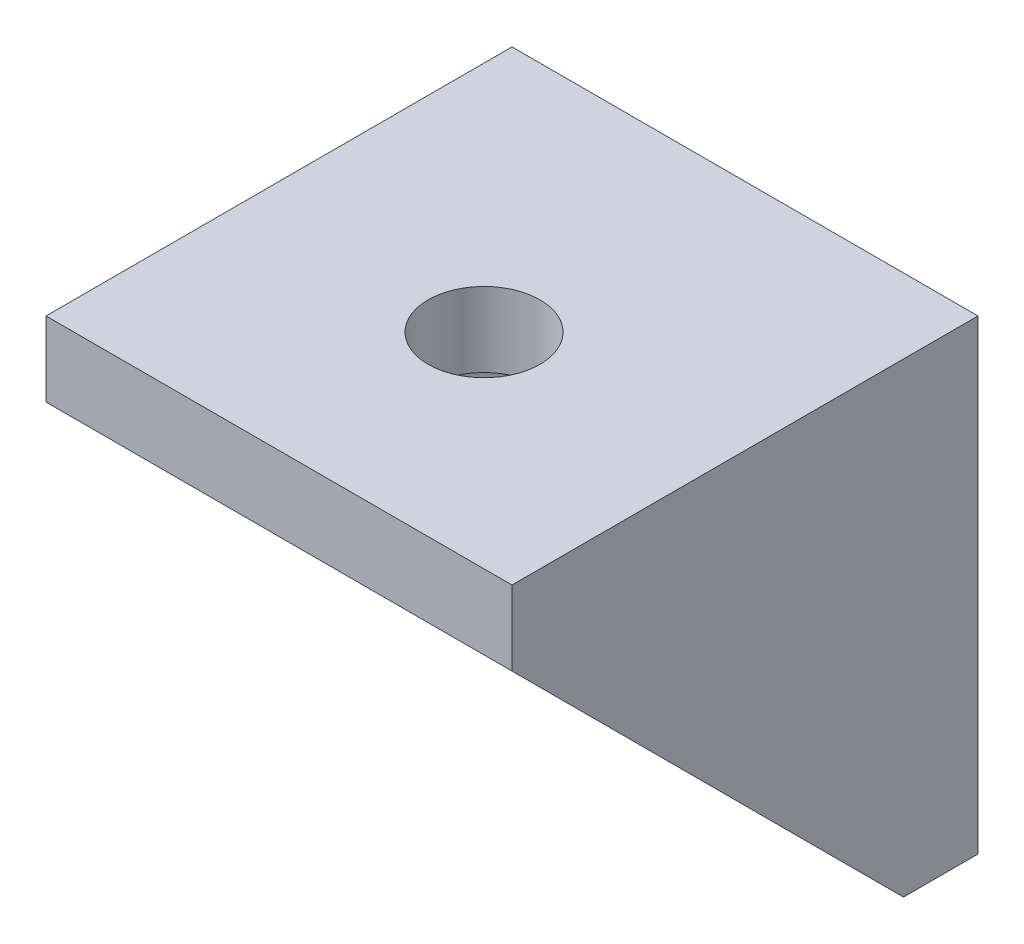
from build123d import *

# Parameters (mm, degrees)
ESQUISSE1_W        = 25
ESQUISSE1_H        = 25
ESQUISSE1_R        = 3
BOSS_EXTRU_1_DEPTH = 4
BOSS_EXTRU_2_START = 12.5
ESQUISSE2_W        = 25
ESQUISSE2_H        = 25
ESQUISSE2_R        = 3
BOSS_EXTRU_2_DEPTH = 4
BOSS_EXTRU_3_START = 12.5
BOSS_EXTRU_3_DEPTH = 4
BOSS_EXTRU_4_START = -12.5
BOSS_EXTRU_4_DEPTH = 4


with BuildPart() as part:
    # Esquisse1 → Boss.-Extru.1 (new body)
    with BuildSketch(Plane.XY):
        Rectangle(ESQUISSE1_W, ESQUISSE1_H)
        Circle(ESQUISSE1_R, mode=Mode.SUBTRACT)
    extrude(amount=BOSS_EXTRU_1_DEPTH)

    # Esquisse2 → Boss.-Extru.2 (add)
    with BuildSketch(Plane(origin=(0, 0, 0), x_dir=(1, 0, 0), z_dir=(0, 1, 0)).offset(BOSS_EXTRU_2_START)):
        with Locations((0, -12.5)):
            Rectangle(ESQUISSE2_W, ESQUISSE2_H)
        with Locations(Location((0, -14, 0), (0, 0, 270))):
            Circle(ESQUISSE2_R, mode=Mode.SUBTRACT)
    extrude(amount=-BOSS_EXTRU_2_DEPTH)

    # Esquisse4 → Boss.-Extru.3 (add)
    with BuildSketch(Plane(origin=(0, 0, 0), x_dir=(0, 0, -1), z_dir=(1, 0, 0)).offset(BOSS_EXTRU_3_START)):
        Polygon((-25, 8.5), (-4, -12.5), (-4, 8.5), align=None)
    extrude(amount=-BOSS_EXTRU_3_DEPTH)

    # Esquisse4_2 → Boss.-Extru.4 (add)
    with BuildSketch(Plane(origin=(0, 0, 0), x_dir=(0, 0, -1), z_dir=(1, 0, 0)).offset(BOSS_EXTRU_4_START)):
        Polygon((-25, 8.5), (-4, -12.5), (-4, 8.5), align=None)
    extrude(amount=BOSS_EXTRU_4_DEPTH)


solid = part.part
